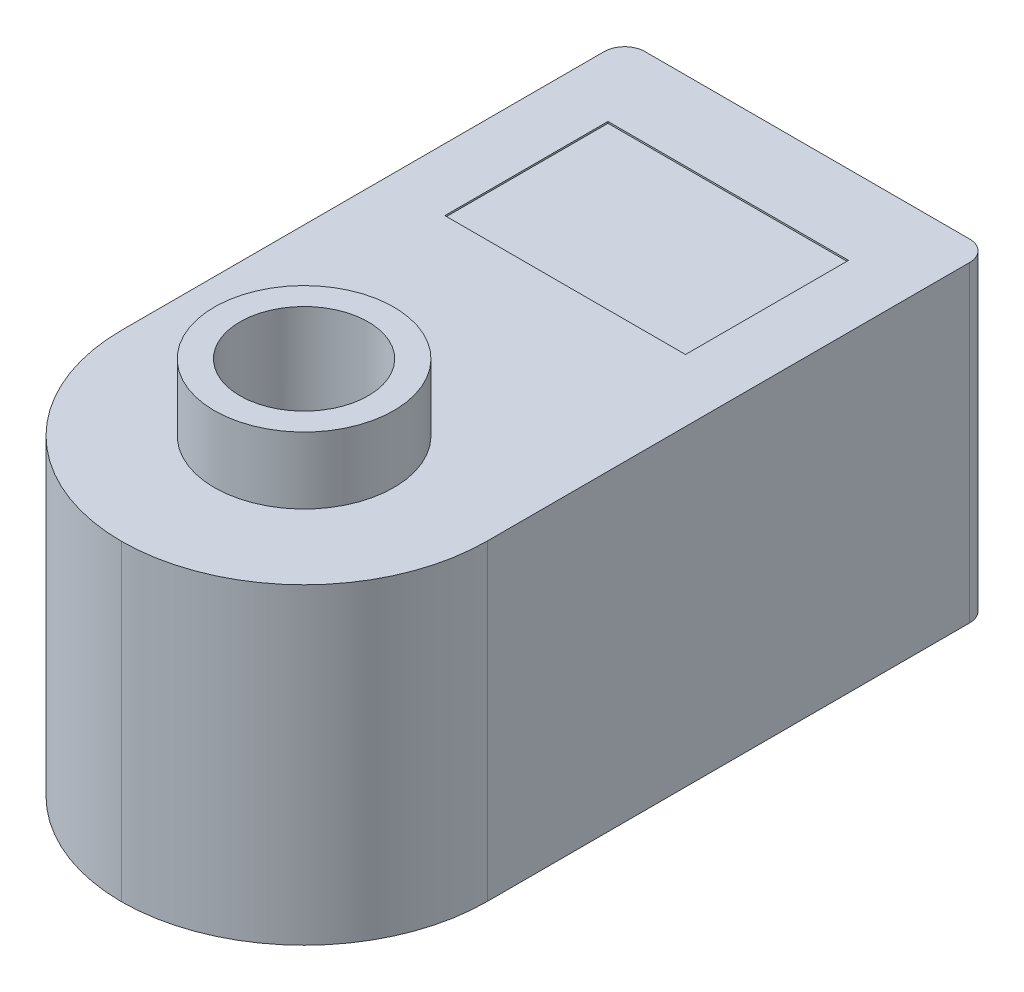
ISO-10303-21;
HEADER;
FILE_DESCRIPTION(('STEP AP214'),'2;1');
FILE_NAME('part.step','',(''),(''),'','','');
FILE_SCHEMA(('AUTOMOTIVE_DESIGN { 1 0 10303 214 1 1 1 1 }'));
ENDSEC;
DATA;
#1=APPLICATION_CONTEXT('core data for automotive mechanical design processes');
#2=APPLICATION_PROTOCOL_DEFINITION('international standard','automotive_design',2000,#1);
#3=PRODUCT_CONTEXT('',#1,'mechanical');
#4=PRODUCT('Part','Part','',(#3));
#5=PRODUCT_RELATED_PRODUCT_CATEGORY('part','',(#4));
#6=PRODUCT_DEFINITION_FORMATION('','',#4);
#7=PRODUCT_DEFINITION_CONTEXT('part definition',#1,'design');
#8=PRODUCT_DEFINITION('design','',#6,#7);
#9=PRODUCT_DEFINITION_SHAPE('','',#8);
#10=(LENGTH_UNIT() NAMED_UNIT(*) SI_UNIT(.MILLI.,.METRE.));
#11=(NAMED_UNIT(*) PLANE_ANGLE_UNIT() SI_UNIT($,.RADIAN.));
#12=(NAMED_UNIT(*) SI_UNIT($,.STERADIAN.) SOLID_ANGLE_UNIT());
#13=UNCERTAINTY_MEASURE_WITH_UNIT(LENGTH_MEASURE(1.E-05),#10,'distance_accuracy_value','');
#14=(GEOMETRIC_REPRESENTATION_CONTEXT(3) GLOBAL_UNCERTAINTY_ASSIGNED_CONTEXT((#13)) GLOBAL_UNIT_ASSIGNED_CONTEXT((#10,
#11,#12)) REPRESENTATION_CONTEXT('',''));
#15=CARTESIAN_POINT('',(0.,0.,0.));
#16=DIRECTION('',(0.,0.,1.));
#17=DIRECTION('',(1.,0.,0.));
#18=AXIS2_PLACEMENT_3D('',#15,#16,#17);
#19=CARTESIAN_POINT('',(0.,-24.35,0.));
#20=DIRECTION('',(0.,1.,0.));
#21=DIRECTION('',(0.,0.,1.));
#22=AXIS2_PLACEMENT_3D('',#19,#20,#21);
#23=CYLINDRICAL_SURFACE('',#22,10.);
#24=CARTESIAN_POINT('',(0.,34.75,0.));
#25=DIRECTION('',(0.,1.,0.));
#26=DIRECTION('',(0.,0.,1.));
#27=AXIS2_PLACEMENT_3D('',#24,#25,#26);
#28=CIRCLE('',#27,10.);
#29=CARTESIAN_POINT('',(0.,34.75,10.));
#30=VERTEX_POINT('',#29);
#31=EDGE_CURVE('E203',#30,#30,#28,.T.);
#32=ORIENTED_EDGE('',*,*,#31,.T.);
#33=EDGE_LOOP('',(#32));
#34=FACE_BOUND('',#33,.T.);
#35=CARTESIAN_POINT('',(0.,-4.34999999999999,0.));
#36=DIRECTION('',(0.,-1.,0.));
#37=DIRECTION('',(0.,0.,-1.));
#38=AXIS2_PLACEMENT_3D('',#35,#36,#37);
#39=CIRCLE('',#38,10.);
#40=CARTESIAN_POINT('',(0.,-4.34999999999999,-10.));
#41=VERTEX_POINT('',#40);
#42=EDGE_CURVE('E44',#41,#41,#39,.F.);
#43=ORIENTED_EDGE('',*,*,#42,.F.);
#44=EDGE_LOOP('',(#43));
#45=FACE_BOUND('',#44,.T.);
#46=ADVANCED_FACE('F40',(#34,#45),#23,.F.);
#47=CARTESIAN_POINT('',(0.,-24.35,0.));
#48=DIRECTION('',(0.,1.,0.));
#49=DIRECTION('',(0.,0.,1.));
#50=AXIS2_PLACEMENT_3D('',#47,#48,#49);
#51=PLANE('',#50);
#52=CARTESIAN_POINT('',(0.,-24.35,0.));
#53=DIRECTION('',(0.,-1.,0.));
#54=DIRECTION('',(0.,0.,-1.));
#55=AXIS2_PLACEMENT_3D('',#52,#53,#54);
#56=CIRCLE('',#55,18.5);
#57=CARTESIAN_POINT('',(0.,-24.35,-18.5000000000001));
#58=VERTEX_POINT('',#57);
#59=EDGE_CURVE('E177',#58,#58,#56,.T.);
#60=ORIENTED_EDGE('',*,*,#59,.F.);
#61=EDGE_LOOP('',(#60));
#62=FACE_BOUND('',#61,.T.);
#63=DIRECTION('',(0.,0.,1.));
#64=VECTOR('',#63,1.);
#65=CARTESIAN_POINT('',(-28.5000000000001,-24.35,-78.5000000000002));
#66=LINE('',#65,#64);
#67=CARTESIAN_POINT('',(-28.5000000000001,-24.35,-75.3250000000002));
#68=VERTEX_POINT('',#67);
#69=CARTESIAN_POINT('',(-28.5000000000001,-24.35,-0.0749999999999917));
#70=VERTEX_POINT('',#69);
#71=EDGE_CURVE('E212',#68,#70,#66,.T.);
#72=ORIENTED_EDGE('',*,*,#71,.F.);
#73=CARTESIAN_POINT('',(-25.325,-24.35,-75.3250000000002));
#74=DIRECTION('',(0.,1.,0.));
#75=DIRECTION('',(0.,0.,1.));
#76=AXIS2_PLACEMENT_3D('',#73,#74,#75);
#77=CIRCLE('',#76,3.175);
#78=CARTESIAN_POINT('',(-25.325,-24.35,-78.5000000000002));
#79=VERTEX_POINT('',#78);
#80=EDGE_CURVE('E269',#68,#79,#77,.F.);
#81=ORIENTED_EDGE('',*,*,#80,.T.);
#82=DIRECTION('',(-1.,0.,0.));
#83=VECTOR('',#82,1.);
#84=CARTESIAN_POINT('',(-28.5000000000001,-24.35,-78.5000000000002));
#85=LINE('',#84,#83);
#86=CARTESIAN_POINT('',(25.3250000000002,-24.35,-78.5000000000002));
#87=VERTEX_POINT('',#86);
#88=EDGE_CURVE('E220',#87,#79,#85,.T.);
#89=ORIENTED_EDGE('',*,*,#88,.F.);
#90=CARTESIAN_POINT('',(25.3250000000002,-24.35,-75.3250000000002));
#91=DIRECTION('',(0.,1.,0.));
#92=DIRECTION('',(0.,0.,1.));
#93=AXIS2_PLACEMENT_3D('',#90,#91,#92);
#94=CIRCLE('',#93,3.175);
#95=CARTESIAN_POINT('',(28.5000000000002,-24.35,-75.3250000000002));
#96=VERTEX_POINT('',#95);
#97=EDGE_CURVE('E266',#87,#96,#94,.F.);
#98=ORIENTED_EDGE('',*,*,#97,.T.);
#99=DIRECTION('',(0.,0.,-1.));
#100=VECTOR('',#99,1.);
#101=CARTESIAN_POINT('',(28.5000000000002,-24.35,-78.5000000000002));
#102=LINE('',#101,#100);
#103=CARTESIAN_POINT('',(28.5000000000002,-24.35,-0.0750000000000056));
#104=VERTEX_POINT('',#103);
#105=EDGE_CURVE('E230',#104,#96,#102,.T.);
#106=ORIENTED_EDGE('',*,*,#105,.F.);
#107=CARTESIAN_POINT('',(-0.0749999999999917,-24.35,-0.0750000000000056));
#108=DIRECTION('',(0.,1.,0.));
#109=DIRECTION('',(0.,0.,1.));
#110=AXIS2_PLACEMENT_3D('',#107,#108,#109);
#111=CIRCLE('',#110,28.575);
#112=CARTESIAN_POINT('',(-1.31838984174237E-12,-24.35,28.4999015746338));
#113=VERTEX_POINT('',#112);
#114=EDGE_CURVE('E243',#104,#113,#111,.F.);
#115=ORIENTED_EDGE('',*,*,#114,.T.);
#116=CARTESIAN_POINT('',(0.0750000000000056,-24.35,-0.0750000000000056));
#117=DIRECTION('',(0.,1.,0.));
#118=DIRECTION('',(0.,0.,1.));
#119=AXIS2_PLACEMENT_3D('',#116,#117,#118);
#120=CIRCLE('',#119,28.575);
#121=EDGE_CURVE('E239',#113,#70,#120,.F.);
#122=ORIENTED_EDGE('',*,*,#121,.T.);
#123=EDGE_LOOP('',(#72,#81,#89,#98,#106,#115,#122));
#124=FACE_BOUND('',#123,.T.);
#125=CARTESIAN_POINT('',(0.,-24.35,-68.0000000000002));
#126=DIRECTION('',(0.,1.,0.));
#127=DIRECTION('',(0.,0.,1.));
#128=AXIS2_PLACEMENT_3D('',#125,#126,#127);
#129=CIRCLE('',#128,3.);
#130=CARTESIAN_POINT('',(0.,-24.35,-65.0000000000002));
#131=VERTEX_POINT('',#130);
#132=EDGE_CURVE('E255',#131,#131,#129,.F.);
#133=ORIENTED_EDGE('',*,*,#132,.F.);
#134=EDGE_LOOP('',(#133));
#135=FACE_BOUND('',#134,.T.);
#136=ADVANCED_FACE('F300',(#62,#124,#135),#51,.F.);
#137=CARTESIAN_POINT('',(0.,24.35,0.));
#138=DIRECTION('',(0.,1.,0.));
#139=DIRECTION('',(0.,0.,1.));
#140=AXIS2_PLACEMENT_3D('',#137,#138,#139);
#141=PLANE('',#140);
#142=DIRECTION('',(0.,0.,1.));
#143=VECTOR('',#142,1.);
#144=CARTESIAN_POINT('',(-18.7675886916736,24.35,-66.1729177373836));
#145=LINE('',#144,#143);
#146=CARTESIAN_POINT('',(-18.7675886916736,24.35,-66.1729177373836));
#147=VERTEX_POINT('',#146);
#148=CARTESIAN_POINT('',(-18.7675886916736,24.35,-40.7338640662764));
#149=VERTEX_POINT('',#148);
#150=EDGE_CURVE('E60',#147,#149,#145,.T.);
#151=ORIENTED_EDGE('',*,*,#150,.F.);
#152=DIRECTION('',(-1.,0.,0.));
#153=VECTOR('',#152,1.);
#154=CARTESIAN_POINT('',(-18.7675886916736,24.35,-66.1729177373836));
#155=LINE('',#154,#153);
#156=CARTESIAN_POINT('',(18.7675886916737,24.35,-66.1729177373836));
#157=VERTEX_POINT('',#156);
#158=EDGE_CURVE('E168',#157,#147,#155,.T.);
#159=ORIENTED_EDGE('',*,*,#158,.F.);
#160=DIRECTION('',(0.,0.,-1.));
#161=VECTOR('',#160,1.);
#162=CARTESIAN_POINT('',(18.7675886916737,24.35,-66.1729177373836));
#163=LINE('',#162,#161);
#164=CARTESIAN_POINT('',(18.7675886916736,24.35,-40.7338640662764));
#165=VERTEX_POINT('',#164);
#166=EDGE_CURVE('E174',#165,#157,#163,.T.);
#167=ORIENTED_EDGE('',*,*,#166,.F.);
#168=DIRECTION('',(1.,0.,0.));
#169=VECTOR('',#168,1.);
#170=CARTESIAN_POINT('',(-18.7675886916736,24.35,-40.7338640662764));
#171=LINE('',#170,#169);
#172=EDGE_CURVE('E185',#149,#165,#171,.T.);
#173=ORIENTED_EDGE('',*,*,#172,.F.);
#174=EDGE_LOOP('',(#151,#159,#167,#173));
#175=FACE_BOUND('',#174,.T.);
#176=DIRECTION('',(-1.,0.,0.));
#177=VECTOR('',#176,1.);
#178=CARTESIAN_POINT('',(-28.5000000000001,24.35,-78.5000000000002));
#179=LINE('',#178,#177);
#180=CARTESIAN_POINT('',(25.3250000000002,24.35,-78.5000000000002));
#181=VERTEX_POINT('',#180);
#182=CARTESIAN_POINT('',(-25.325,24.35,-78.5000000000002));
#183=VERTEX_POINT('',#182);
#184=EDGE_CURVE('E223',#181,#183,#179,.T.);
#185=ORIENTED_EDGE('',*,*,#184,.T.);
#186=CARTESIAN_POINT('',(-25.325,24.35,-75.3250000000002));
#187=DIRECTION('',(0.,1.,0.));
#188=DIRECTION('',(0.,0.,1.));
#189=AXIS2_PLACEMENT_3D('',#186,#187,#188);
#190=CIRCLE('',#189,3.175);
#191=CARTESIAN_POINT('',(-28.5000000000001,24.35,-75.3250000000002));
#192=VERTEX_POINT('',#191);
#193=EDGE_CURVE('E50',#183,#192,#190,.T.);
#194=ORIENTED_EDGE('',*,*,#193,.T.);
#195=DIRECTION('',(0.,0.,1.));
#196=VECTOR('',#195,1.);
#197=CARTESIAN_POINT('',(-28.5000000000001,24.35,-78.5000000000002));
#198=LINE('',#197,#196);
#199=CARTESIAN_POINT('',(-28.5000000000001,24.35,-0.0749999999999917));
#200=VERTEX_POINT('',#199);
#201=EDGE_CURVE('E216',#192,#200,#198,.T.);
#202=ORIENTED_EDGE('',*,*,#201,.T.);
#203=CARTESIAN_POINT('',(0.0750000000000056,24.35,-0.0750000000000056));
#204=DIRECTION('',(0.,1.,0.));
#205=DIRECTION('',(0.,0.,1.));
#206=AXIS2_PLACEMENT_3D('',#203,#204,#205);
#207=CIRCLE('',#206,28.575);
#208=CARTESIAN_POINT('',(-1.31838984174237E-12,24.35,28.4999015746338));
#209=VERTEX_POINT('',#208);
#210=EDGE_CURVE('E245',#200,#209,#207,.T.);
#211=ORIENTED_EDGE('',*,*,#210,.T.);
#212=CARTESIAN_POINT('',(-0.0749999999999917,24.35,-0.0750000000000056));
#213=DIRECTION('',(0.,1.,0.));
#214=DIRECTION('',(0.,0.,1.));
#215=AXIS2_PLACEMENT_3D('',#212,#213,#214);
#216=CIRCLE('',#215,28.575);
#217=CARTESIAN_POINT('',(28.5000000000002,24.35,-0.0750000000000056));
#218=VERTEX_POINT('',#217);
#219=EDGE_CURVE('E248',#209,#218,#216,.T.);
#220=ORIENTED_EDGE('',*,*,#219,.T.);
#221=DIRECTION('',(0.,0.,-1.));
#222=VECTOR('',#221,1.);
#223=CARTESIAN_POINT('',(28.5000000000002,24.35,-78.5000000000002));
#224=LINE('',#223,#222);
#225=CARTESIAN_POINT('',(28.5000000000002,24.35,-75.3250000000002));
#226=VERTEX_POINT('',#225);
#227=EDGE_CURVE('E219',#218,#226,#224,.T.);
#228=ORIENTED_EDGE('',*,*,#227,.T.);
#229=CARTESIAN_POINT('',(25.3250000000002,24.35,-75.3250000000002));
#230=DIRECTION('',(0.,1.,0.));
#231=DIRECTION('',(0.,0.,1.));
#232=AXIS2_PLACEMENT_3D('',#229,#230,#231);
#233=CIRCLE('',#232,3.175);
#234=EDGE_CURVE('E279',#226,#181,#233,.T.);
#235=ORIENTED_EDGE('',*,*,#234,.T.);
#236=EDGE_LOOP('',(#185,#194,#202,#211,#220,#228,#235));
#237=FACE_BOUND('',#236,.T.);
#238=CARTESIAN_POINT('',(0.,24.35,0.));
#239=DIRECTION('',(0.,1.,0.));
#240=DIRECTION('',(0.,0.,1.));
#241=AXIS2_PLACEMENT_3D('',#238,#239,#240);
#242=CIRCLE('',#241,14.);
#243=CARTESIAN_POINT('',(0.,24.35,14.));
#244=VERTEX_POINT('',#243);
#245=EDGE_CURVE('E207',#244,#244,#242,.T.);
#246=ORIENTED_EDGE('',*,*,#245,.F.);
#247=EDGE_LOOP('',(#246));
#248=FACE_BOUND('',#247,.T.);
#249=ADVANCED_FACE('F286',(#175,#237,#248),#141,.T.);
#250=CARTESIAN_POINT('',(-28.5000000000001,24.35,-78.5000000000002));
#251=DIRECTION('',(1.,0.,0.));
#252=DIRECTION('',(0.,0.,-1.));
#253=AXIS2_PLACEMENT_3D('',#250,#251,#252);
#254=PLANE('',#253);
#255=ORIENTED_EDGE('',*,*,#201,.F.);
#256=DIRECTION('',(0.,-1.,0.));
#257=VECTOR('',#256,1.);
#258=CARTESIAN_POINT('',(-28.5000000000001,24.35,-75.3250000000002));
#259=LINE('',#258,#257);
#260=EDGE_CURVE('E262',#192,#68,#259,.T.);
#261=ORIENTED_EDGE('',*,*,#260,.T.);
#262=ORIENTED_EDGE('',*,*,#71,.T.);
#263=DIRECTION('',(0.,-1.,0.));
#264=VECTOR('',#263,1.);
#265=CARTESIAN_POINT('',(-28.5000000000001,24.35,-0.0749999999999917));
#266=LINE('',#265,#264);
#267=EDGE_CURVE('E251',#70,#200,#266,.F.);
#268=ORIENTED_EDGE('',*,*,#267,.T.);
#269=EDGE_LOOP('',(#255,#261,#262,#268));
#270=FACE_BOUND('',#269,.T.);
#271=ADVANCED_FACE('F293',(#270),#254,.F.);
#272=CARTESIAN_POINT('',(28.5000000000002,24.35,-78.5000000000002));
#273=DIRECTION('',(-1.,0.,0.));
#274=DIRECTION('',(0.,0.,1.));
#275=AXIS2_PLACEMENT_3D('',#272,#273,#274);
#276=PLANE('',#275);
#277=ORIENTED_EDGE('',*,*,#105,.T.);
#278=DIRECTION('',(0.,-1.,0.));
#279=VECTOR('',#278,1.);
#280=CARTESIAN_POINT('',(28.5000000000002,24.35,-75.3250000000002));
#281=LINE('',#280,#279);
#282=EDGE_CURVE('E11',#96,#226,#281,.F.);
#283=ORIENTED_EDGE('',*,*,#282,.T.);
#284=ORIENTED_EDGE('',*,*,#227,.F.);
#285=DIRECTION('',(0.,-1.,0.));
#286=VECTOR('',#285,1.);
#287=CARTESIAN_POINT('',(28.5000000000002,24.35,-0.0750000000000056));
#288=LINE('',#287,#286);
#289=EDGE_CURVE('E227',#218,#104,#288,.T.);
#290=ORIENTED_EDGE('',*,*,#289,.T.);
#291=EDGE_LOOP('',(#277,#283,#284,#290));
#292=FACE_BOUND('',#291,.T.);
#293=ADVANCED_FACE('F308',(#292),#276,.F.);
#294=CARTESIAN_POINT('',(-28.5000000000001,24.35,-78.5000000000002));
#295=DIRECTION('',(0.,0.,1.));
#296=DIRECTION('',(1.,0.,0.));
#297=AXIS2_PLACEMENT_3D('',#294,#295,#296);
#298=PLANE('',#297);
#299=ORIENTED_EDGE('',*,*,#88,.T.);
#300=DIRECTION('',(0.,-1.,0.));
#301=VECTOR('',#300,1.);
#302=CARTESIAN_POINT('',(-25.325,24.35,-78.5000000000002));
#303=LINE('',#302,#301);
#304=EDGE_CURVE('E276',#79,#183,#303,.F.);
#305=ORIENTED_EDGE('',*,*,#304,.T.);
#306=ORIENTED_EDGE('',*,*,#184,.F.);
#307=DIRECTION('',(0.,-1.,0.));
#308=VECTOR('',#307,1.);
#309=CARTESIAN_POINT('',(25.3250000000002,24.35,-78.5000000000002));
#310=LINE('',#309,#308);
#311=EDGE_CURVE('E272',#181,#87,#310,.T.);
#312=ORIENTED_EDGE('',*,*,#311,.T.);
#313=EDGE_LOOP('',(#299,#305,#306,#312));
#314=FACE_BOUND('',#313,.T.);
#315=ADVANCED_FACE('F303',(#314),#298,.F.);
#316=CARTESIAN_POINT('',(0.,34.75,0.));
#317=DIRECTION('',(0.,-1.,0.));
#318=DIRECTION('',(0.,0.,-1.));
#319=AXIS2_PLACEMENT_3D('',#316,#317,#318);
#320=CYLINDRICAL_SURFACE('',#319,14.);
#321=CARTESIAN_POINT('',(0.,34.75,0.));
#322=DIRECTION('',(0.,1.,0.));
#323=DIRECTION('',(0.,0.,1.));
#324=AXIS2_PLACEMENT_3D('',#321,#322,#323);
#325=CIRCLE('',#324,14.);
#326=CARTESIAN_POINT('',(0.,34.75,14.));
#327=VERTEX_POINT('',#326);
#328=EDGE_CURVE('E208',#327,#327,#325,.T.);
#329=ORIENTED_EDGE('',*,*,#328,.F.);
#330=EDGE_LOOP('',(#329));
#331=FACE_BOUND('',#330,.T.);
#332=ORIENTED_EDGE('',*,*,#245,.T.);
#333=EDGE_LOOP('',(#332));
#334=FACE_BOUND('',#333,.T.);
#335=ADVANCED_FACE('F326',(#331,#334),#320,.T.);
#336=CARTESIAN_POINT('',(0.,34.75,0.));
#337=DIRECTION('',(0.,1.,0.));
#338=DIRECTION('',(0.,0.,1.));
#339=AXIS2_PLACEMENT_3D('',#336,#337,#338);
#340=PLANE('',#339);
#341=ORIENTED_EDGE('',*,*,#31,.F.);
#342=EDGE_LOOP('',(#341));
#343=FACE_BOUND('',#342,.T.);
#344=ORIENTED_EDGE('',*,*,#328,.T.);
#345=EDGE_LOOP('',(#344));
#346=FACE_BOUND('',#345,.T.);
#347=ADVANCED_FACE('F318',(#343,#346),#340,.T.);
#348=CARTESIAN_POINT('',(0.0750000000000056,24.35,-0.0750000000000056));
#349=DIRECTION('',(0.,-1.,0.));
#350=DIRECTION('',(0.,0.,-1.));
#351=AXIS2_PLACEMENT_3D('',#348,#349,#350);
#352=CYLINDRICAL_SURFACE('',#351,28.575);
#353=DIRECTION('',(0.,-1.,0.));
#354=VECTOR('',#353,1.);
#355=CARTESIAN_POINT('',(-1.31838984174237E-12,0.,28.4999015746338));
#356=LINE('',#355,#354);
#357=EDGE_CURVE('E202',#209,#113,#356,.T.);
#358=ORIENTED_EDGE('',*,*,#357,.F.);
#359=ORIENTED_EDGE('',*,*,#210,.F.);
#360=ORIENTED_EDGE('',*,*,#267,.F.);
#361=ORIENTED_EDGE('',*,*,#121,.F.);
#362=EDGE_LOOP('',(#358,#359,#360,#361));
#363=FACE_BOUND('',#362,.T.);
#364=ADVANCED_FACE('F316',(#363),#352,.T.);
#365=CARTESIAN_POINT('',(-0.0749999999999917,24.35,-0.0750000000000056));
#366=DIRECTION('',(0.,-1.,0.));
#367=DIRECTION('',(0.,0.,-1.));
#368=AXIS2_PLACEMENT_3D('',#365,#366,#367);
#369=CYLINDRICAL_SURFACE('',#368,28.575);
#370=ORIENTED_EDGE('',*,*,#219,.F.);
#371=ORIENTED_EDGE('',*,*,#357,.T.);
#372=ORIENTED_EDGE('',*,*,#114,.F.);
#373=ORIENTED_EDGE('',*,*,#289,.F.);
#374=EDGE_LOOP('',(#370,#371,#372,#373));
#375=FACE_BOUND('',#374,.T.);
#376=ADVANCED_FACE('F312',(#375),#369,.T.);
#377=CARTESIAN_POINT('',(0.,-30.85,-68.0000000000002));
#378=DIRECTION('',(0.,1.,0.));
#379=DIRECTION('',(0.,0.,1.));
#380=AXIS2_PLACEMENT_3D('',#377,#378,#379);
#381=CYLINDRICAL_SURFACE('',#380,3.);
#382=CARTESIAN_POINT('',(0.,-30.85,-68.0000000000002));
#383=DIRECTION('',(0.,-1.,0.));
#384=DIRECTION('',(0.,0.,-1.));
#385=AXIS2_PLACEMENT_3D('',#382,#383,#384);
#386=CIRCLE('',#385,3.);
#387=CARTESIAN_POINT('',(0.,-30.85,-65.0000000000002));
#388=VERTEX_POINT('',#387);
#389=EDGE_CURVE('E193',#388,#388,#386,.T.);
#390=CARTESIAN_POINT('',(0.,-30.85,-65.0000000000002));
#391=CARTESIAN_POINT('',(0.,-30.7822916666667,-65.0000000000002));
#392=CARTESIAN_POINT('',(0.,-30.7145833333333,-65.0000000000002));
#393=CARTESIAN_POINT('',(0.,-30.5791666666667,-65.0000000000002));
#394=CARTESIAN_POINT('',(0.,-30.5114583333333,-65.0000000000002));
#395=CARTESIAN_POINT('',(0.,-30.3760416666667,-65.0000000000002));
#396=CARTESIAN_POINT('',(0.,-30.3083333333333,-65.0000000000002));
#397=CARTESIAN_POINT('',(0.,-30.1729166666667,-65.0000000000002));
#398=CARTESIAN_POINT('',(0.,-30.1052083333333,-65.0000000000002));
#399=CARTESIAN_POINT('',(0.,-29.9697916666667,-65.0000000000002));
#400=CARTESIAN_POINT('',(0.,-29.9020833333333,-65.0000000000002));
#401=CARTESIAN_POINT('',(0.,-29.7666666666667,-65.0000000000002));
#402=CARTESIAN_POINT('',(0.,-29.6989583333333,-65.0000000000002));
#403=CARTESIAN_POINT('',(0.,-29.5635416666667,-65.0000000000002));
#404=CARTESIAN_POINT('',(0.,-29.4958333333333,-65.0000000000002));
#405=CARTESIAN_POINT('',(0.,-29.3604166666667,-65.0000000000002));
#406=CARTESIAN_POINT('',(0.,-29.2927083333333,-65.0000000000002));
#407=CARTESIAN_POINT('',(0.,-29.1572916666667,-65.0000000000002));
#408=CARTESIAN_POINT('',(0.,-29.0895833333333,-65.0000000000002));
#409=CARTESIAN_POINT('',(0.,-28.9541666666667,-65.0000000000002));
#410=CARTESIAN_POINT('',(0.,-28.8864583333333,-65.0000000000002));
#411=CARTESIAN_POINT('',(0.,-28.7510416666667,-65.0000000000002));
#412=CARTESIAN_POINT('',(0.,-28.6833333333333,-65.0000000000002));
#413=CARTESIAN_POINT('',(0.,-28.5479166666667,-65.0000000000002));
#414=CARTESIAN_POINT('',(0.,-28.4802083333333,-65.0000000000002));
#415=CARTESIAN_POINT('',(0.,-28.3447916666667,-65.0000000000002));
#416=CARTESIAN_POINT('',(0.,-28.2770833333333,-65.0000000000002));
#417=CARTESIAN_POINT('',(0.,-28.1416666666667,-65.0000000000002));
#418=CARTESIAN_POINT('',(0.,-28.0739583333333,-65.0000000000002));
#419=CARTESIAN_POINT('',(0.,-27.9385416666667,-65.0000000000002));
#420=CARTESIAN_POINT('',(0.,-27.8708333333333,-65.0000000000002));
#421=CARTESIAN_POINT('',(0.,-27.7354166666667,-65.0000000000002));
#422=CARTESIAN_POINT('',(0.,-27.6677083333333,-65.0000000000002));
#423=CARTESIAN_POINT('',(0.,-27.5322916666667,-65.0000000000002));
#424=CARTESIAN_POINT('',(0.,-27.4645833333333,-65.0000000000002));
#425=CARTESIAN_POINT('',(0.,-27.3291666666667,-65.0000000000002));
#426=CARTESIAN_POINT('',(0.,-27.2614583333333,-65.0000000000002));
#427=CARTESIAN_POINT('',(0.,-27.1260416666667,-65.0000000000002));
#428=CARTESIAN_POINT('',(0.,-27.0583333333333,-65.0000000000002));
#429=CARTESIAN_POINT('',(0.,-26.9229166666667,-65.0000000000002));
#430=CARTESIAN_POINT('',(0.,-26.8552083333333,-65.0000000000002));
#431=CARTESIAN_POINT('',(0.,-26.7197916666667,-65.0000000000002));
#432=CARTESIAN_POINT('',(0.,-26.6520833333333,-65.0000000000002));
#433=CARTESIAN_POINT('',(0.,-26.5166666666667,-65.0000000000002));
#434=CARTESIAN_POINT('',(0.,-26.4489583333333,-65.0000000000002));
#435=CARTESIAN_POINT('',(0.,-26.3135416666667,-65.0000000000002));
#436=CARTESIAN_POINT('',(0.,-26.2458333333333,-65.0000000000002));
#437=CARTESIAN_POINT('',(0.,-26.1104166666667,-65.0000000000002));
#438=CARTESIAN_POINT('',(0.,-26.0427083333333,-65.0000000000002));
#439=CARTESIAN_POINT('',(0.,-25.9072916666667,-65.0000000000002));
#440=CARTESIAN_POINT('',(0.,-25.8395833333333,-65.0000000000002));
#441=CARTESIAN_POINT('',(0.,-25.7041666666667,-65.0000000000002));
#442=CARTESIAN_POINT('',(0.,-25.6364583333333,-65.0000000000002));
#443=CARTESIAN_POINT('',(0.,-25.5010416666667,-65.0000000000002));
#444=CARTESIAN_POINT('',(0.,-25.4333333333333,-65.0000000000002));
#445=CARTESIAN_POINT('',(0.,-25.2979166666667,-65.0000000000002));
#446=CARTESIAN_POINT('',(0.,-25.2302083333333,-65.0000000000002));
#447=CARTESIAN_POINT('',(0.,-25.0947916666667,-65.0000000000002));
#448=CARTESIAN_POINT('',(0.,-25.0270833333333,-65.0000000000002));
#449=CARTESIAN_POINT('',(0.,-24.8916666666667,-65.0000000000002));
#450=CARTESIAN_POINT('',(0.,-24.8239583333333,-65.0000000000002));
#451=CARTESIAN_POINT('',(0.,-24.6885416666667,-65.0000000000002));
#452=CARTESIAN_POINT('',(0.,-24.6208333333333,-65.0000000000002));
#453=CARTESIAN_POINT('',(0.,-24.4854166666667,-65.0000000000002));
#454=CARTESIAN_POINT('',(0.,-24.4177083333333,-65.0000000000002));
#455=CARTESIAN_POINT('',(0.,-24.35,-65.0000000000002));
#456=B_SPLINE_CURVE_WITH_KNOTS('',3,(#390,#391,#392,#393,#394,#395,#396,#397,#398,#399,#400,
#401,#402,#403,#404,#405,#406,#407,#408,#409,#410,#411,#412,#413,#414,#415,#416,#417,#418,#419,
#420,#421,#422,#423,#424,#425,#426,#427,#428,#429,#430,#431,#432,#433,#434,#435,#436,#437,#438,
#439,#440,#441,#442,#443,#444,#445,#446,#447,#448,#449,#450,#451,#452,#453,#454,#455),
.UNSPECIFIED.,.F.,.F.,(4,2,2,2,2,2,2,2,2,2,2,2,2,2,2,2,2,2,2,2,2,2,2,2,2,2,2,2,2,2,2,2,4),(0.,
0.203124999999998,0.406249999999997,0.609374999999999,0.812499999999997,1.015625,1.21875,
1.421875,1.625,1.828125,2.03125,2.234375,2.4375,2.640625,2.84375,3.046875,3.25,3.453125,3.65625,
3.859375,4.0625,4.265625,4.46875,4.671875,4.875,5.078125,5.28125,5.484375,5.6875,5.890625,
6.09375,6.296875,6.5),.UNSPECIFIED.);
#457=EDGE_CURVE('BSEAM324',#388,#131,#456,.T.);
#458=ORIENTED_EDGE('',*,*,#389,.F.);
#459=ORIENTED_EDGE('',*,*,#132,.T.);
#460=ORIENTED_EDGE('',*,*,#457,.T.);
#461=ORIENTED_EDGE('',*,*,#457,.F.);
#462=EDGE_LOOP('',(#458,#460,#459,#461));
#463=FACE_BOUND('',#462,.T.);
#464=ADVANCED_FACE('F324',(#463),#381,.T.);
#465=CARTESIAN_POINT('',(0.,-30.85,-68.0000000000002));
#466=DIRECTION('',(0.,-1.,0.));
#467=DIRECTION('',(0.,0.,-1.));
#468=AXIS2_PLACEMENT_3D('',#465,#466,#467);
#469=PLANE('',#468);
#470=ORIENTED_EDGE('',*,*,#389,.T.);
#471=EDGE_LOOP('',(#470));
#472=FACE_BOUND('',#471,.T.);
#473=ADVANCED_FACE('F389',(#472),#469,.T.);
#474=CARTESIAN_POINT('',(-25.325,24.35,-75.3250000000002));
#475=DIRECTION('',(0.,-1.,0.));
#476=DIRECTION('',(0.,0.,-1.));
#477=AXIS2_PLACEMENT_3D('',#474,#475,#476);
#478=CYLINDRICAL_SURFACE('',#477,3.175);
#479=ORIENTED_EDGE('',*,*,#193,.F.);
#480=ORIENTED_EDGE('',*,*,#304,.F.);
#481=ORIENTED_EDGE('',*,*,#80,.F.);
#482=ORIENTED_EDGE('',*,*,#260,.F.);
#483=EDGE_LOOP('',(#479,#480,#481,#482));
#484=FACE_BOUND('',#483,.T.);
#485=ADVANCED_FACE('F297',(#484),#478,.T.);
#486=CARTESIAN_POINT('',(25.3250000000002,24.35,-75.3250000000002));
#487=DIRECTION('',(0.,-1.,0.));
#488=DIRECTION('',(0.,0.,-1.));
#489=AXIS2_PLACEMENT_3D('',#486,#487,#488);
#490=CYLINDRICAL_SURFACE('',#489,3.175);
#491=ORIENTED_EDGE('',*,*,#234,.F.);
#492=ORIENTED_EDGE('',*,*,#282,.F.);
#493=ORIENTED_EDGE('',*,*,#97,.F.);
#494=ORIENTED_EDGE('',*,*,#311,.F.);
#495=EDGE_LOOP('',(#491,#492,#493,#494));
#496=FACE_BOUND('',#495,.T.);
#497=ADVANCED_FACE('F42',(#496),#490,.T.);
#498=CARTESIAN_POINT('',(-18.7675886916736,24.096,-66.1729177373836));
#499=DIRECTION('',(-1.,0.,0.));
#500=DIRECTION('',(0.,0.,1.));
#501=AXIS2_PLACEMENT_3D('',#498,#499,#500);
#502=PLANE('',#501);
#503=ORIENTED_EDGE('',*,*,#150,.T.);
#504=DIRECTION('',(0.,1.,0.));
#505=VECTOR('',#504,1.);
#506=CARTESIAN_POINT('',(-18.7675886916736,24.096,-40.7338640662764));
#507=LINE('',#506,#505);
#508=CARTESIAN_POINT('',(-18.7675886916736,24.096,-40.7338640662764));
#509=VERTEX_POINT('',#508);
#510=EDGE_CURVE('E143',#509,#149,#507,.T.);
#511=ORIENTED_EDGE('',*,*,#510,.F.);
#512=DIRECTION('',(0.,0.,1.));
#513=VECTOR('',#512,1.);
#514=CARTESIAN_POINT('',(-18.7675886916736,24.096,-66.1729177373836));
#515=LINE('',#514,#513);
#516=CARTESIAN_POINT('',(-18.7675886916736,24.096,-66.1729177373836));
#517=VERTEX_POINT('',#516);
#518=EDGE_CURVE('E147',#517,#509,#515,.T.);
#519=ORIENTED_EDGE('',*,*,#518,.F.);
#520=DIRECTION('',(0.,1.,0.));
#521=VECTOR('',#520,1.);
#522=CARTESIAN_POINT('',(-18.7675886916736,24.096,-66.1729177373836));
#523=LINE('',#522,#521);
#524=EDGE_CURVE('E191',#517,#147,#523,.T.);
#525=ORIENTED_EDGE('',*,*,#524,.T.);
#526=EDGE_LOOP('',(#503,#511,#519,#525));
#527=FACE_BOUND('',#526,.T.);
#528=ADVANCED_FACE('F145',(#527),#502,.F.);
#529=CARTESIAN_POINT('',(-18.7675886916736,24.096,-66.1729177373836));
#530=DIRECTION('',(0.,0.,-1.));
#531=DIRECTION('',(-1.,0.,0.));
#532=AXIS2_PLACEMENT_3D('',#529,#530,#531);
#533=PLANE('',#532);
#534=ORIENTED_EDGE('',*,*,#158,.T.);
#535=ORIENTED_EDGE('',*,*,#524,.F.);
#536=DIRECTION('',(-1.,0.,0.));
#537=VECTOR('',#536,1.);
#538=CARTESIAN_POINT('',(-18.7675886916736,24.096,-66.1729177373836));
#539=LINE('',#538,#537);
#540=CARTESIAN_POINT('',(18.7675886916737,24.096,-66.1729177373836));
#541=VERTEX_POINT('',#540);
#542=EDGE_CURVE('E154',#541,#517,#539,.T.);
#543=ORIENTED_EDGE('',*,*,#542,.F.);
#544=DIRECTION('',(0.,1.,0.));
#545=VECTOR('',#544,1.);
#546=CARTESIAN_POINT('',(18.7675886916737,24.096,-66.1729177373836));
#547=LINE('',#546,#545);
#548=EDGE_CURVE('E194',#541,#157,#547,.T.);
#549=ORIENTED_EDGE('',*,*,#548,.T.);
#550=EDGE_LOOP('',(#534,#535,#543,#549));
#551=FACE_BOUND('',#550,.T.);
#552=ADVANCED_FACE('F412',(#551),#533,.F.);
#553=CARTESIAN_POINT('',(18.7675886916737,24.096,-66.1729177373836));
#554=DIRECTION('',(1.,0.,0.));
#555=DIRECTION('',(0.,0.,-1.));
#556=AXIS2_PLACEMENT_3D('',#553,#554,#555);
#557=PLANE('',#556);
#558=ORIENTED_EDGE('',*,*,#166,.T.);
#559=ORIENTED_EDGE('',*,*,#548,.F.);
#560=DIRECTION('',(0.,0.,-1.));
#561=VECTOR('',#560,1.);
#562=CARTESIAN_POINT('',(18.7675886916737,24.096,-66.1729177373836));
#563=LINE('',#562,#561);
#564=CARTESIAN_POINT('',(18.7675886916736,24.096,-40.7338640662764));
#565=VERTEX_POINT('',#564);
#566=EDGE_CURVE('E163',#565,#541,#563,.T.);
#567=ORIENTED_EDGE('',*,*,#566,.F.);
#568=DIRECTION('',(0.,1.,0.));
#569=VECTOR('',#568,1.);
#570=CARTESIAN_POINT('',(18.7675886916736,24.096,-40.7338640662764));
#571=LINE('',#570,#569);
#572=EDGE_CURVE('E153',#565,#165,#571,.T.);
#573=ORIENTED_EDGE('',*,*,#572,.T.);
#574=EDGE_LOOP('',(#558,#559,#567,#573));
#575=FACE_BOUND('',#574,.T.);
#576=ADVANCED_FACE('F419',(#575),#557,.F.);
#577=CARTESIAN_POINT('',(-18.7675886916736,24.096,-40.7338640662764));
#578=DIRECTION('',(0.,0.,1.));
#579=DIRECTION('',(1.,0.,0.));
#580=AXIS2_PLACEMENT_3D('',#577,#578,#579);
#581=PLANE('',#580);
#582=ORIENTED_EDGE('',*,*,#172,.T.);
#583=ORIENTED_EDGE('',*,*,#572,.F.);
#584=DIRECTION('',(1.,0.,0.));
#585=VECTOR('',#584,1.);
#586=CARTESIAN_POINT('',(-18.7675886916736,24.096,-40.7338640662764));
#587=LINE('',#586,#585);
#588=EDGE_CURVE('E157',#509,#565,#587,.T.);
#589=ORIENTED_EDGE('',*,*,#588,.F.);
#590=ORIENTED_EDGE('',*,*,#510,.T.);
#591=EDGE_LOOP('',(#582,#583,#589,#590));
#592=FACE_BOUND('',#591,.T.);
#593=ADVANCED_FACE('F158',(#592),#581,.F.);
#594=CARTESIAN_POINT('',(0.,24.096,0.));
#595=DIRECTION('',(0.,1.,0.));
#596=DIRECTION('',(0.,0.,1.));
#597=AXIS2_PLACEMENT_3D('',#594,#595,#596);
#598=PLANE('',#597);
#599=ORIENTED_EDGE('',*,*,#518,.T.);
#600=ORIENTED_EDGE('',*,*,#588,.T.);
#601=ORIENTED_EDGE('',*,*,#566,.T.);
#602=ORIENTED_EDGE('',*,*,#542,.T.);
#603=EDGE_LOOP('',(#599,#600,#601,#602));
#604=FACE_BOUND('',#603,.T.);
#605=ADVANCED_FACE('F165',(#604),#598,.T.);
#606=CARTESIAN_POINT('',(0.,-4.34999999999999,0.));
#607=DIRECTION('',(0.,-1.,0.));
#608=DIRECTION('',(0.,0.,-1.));
#609=AXIS2_PLACEMENT_3D('',#606,#607,#608);
#610=PLANE('',#609);
#611=CARTESIAN_POINT('',(0.,-4.34999999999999,0.));
#612=DIRECTION('',(0.,-1.,0.));
#613=DIRECTION('',(0.,0.,-1.));
#614=AXIS2_PLACEMENT_3D('',#611,#612,#613);
#615=CIRCLE('',#614,18.5);
#616=CARTESIAN_POINT('',(0.,-4.34999999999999,-18.5000000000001));
#617=VERTEX_POINT('',#616);
#618=EDGE_CURVE('E463',#617,#617,#615,.T.);
#619=ORIENTED_EDGE('',*,*,#618,.T.);
#620=EDGE_LOOP('',(#619));
#621=FACE_BOUND('',#620,.T.);
#622=ORIENTED_EDGE('',*,*,#42,.T.);
#623=EDGE_LOOP('',(#622));
#624=FACE_BOUND('',#623,.T.);
#625=ADVANCED_FACE('F440',(#621,#624),#610,.T.);
#626=CARTESIAN_POINT('',(0.,-4.34999999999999,0.));
#627=DIRECTION('',(0.,-1.,0.));
#628=DIRECTION('',(0.,0.,-1.));
#629=AXIS2_PLACEMENT_3D('',#626,#627,#628);
#630=CYLINDRICAL_SURFACE('',#629,18.5);
#631=ORIENTED_EDGE('',*,*,#618,.F.);
#632=EDGE_LOOP('',(#631));
#633=FACE_BOUND('',#632,.T.);
#634=ORIENTED_EDGE('',*,*,#59,.T.);
#635=EDGE_LOOP('',(#634));
#636=FACE_BOUND('',#635,.T.);
#637=ADVANCED_FACE('F450',(#633,#636),#630,.F.);
#638=CLOSED_SHELL('',(#46,#136,#249,#271,#293,#315,#335,#347,#364,#376,#464,#473,#485,#497,#528,
#552,#576,#593,#605,#625,#637));
#639=MANIFOLD_SOLID_BREP('B2',#638);
#640=ADVANCED_BREP_SHAPE_REPRESENTATION('',(#18,#639),#14);
#641=SHAPE_DEFINITION_REPRESENTATION(#9,#640);
ENDSEC;
END-ISO-10303-21;
